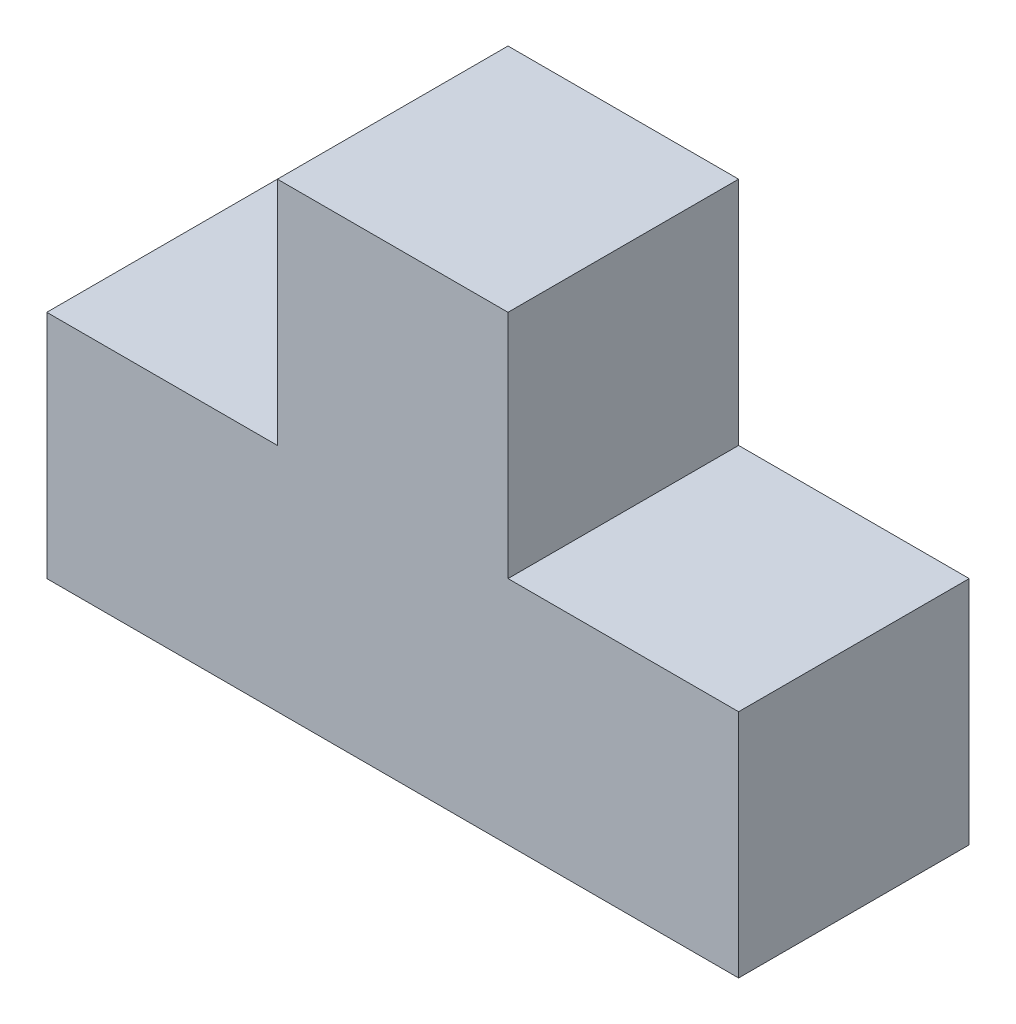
from build123d import *

# Parameters (mm, degrees)
SKETCH1_W      = 50.8
SKETCH1_H      = 50.8
EXTRUDE1_DEPTH = 25.4


with BuildPart() as part:
    # Sketch1 → Extrude1 (new, symmetric)
    with BuildSketch(Plane.XY):
        Polygon((-25.4, 50.8), (-25.4, 0), (25.4, 0), (25.4, 50.8), (25.4, 101.6), (-25.4, 101.6), align=None)
        with Locations((-50.8, 25.4)):
            Rectangle(SKETCH1_W, SKETCH1_H)
        with Locations((50.8, 25.4)):
            Rectangle(SKETCH1_W, SKETCH1_H)
    extrude(amount=EXTRUDE1_DEPTH, both=True)


solid = part.part
